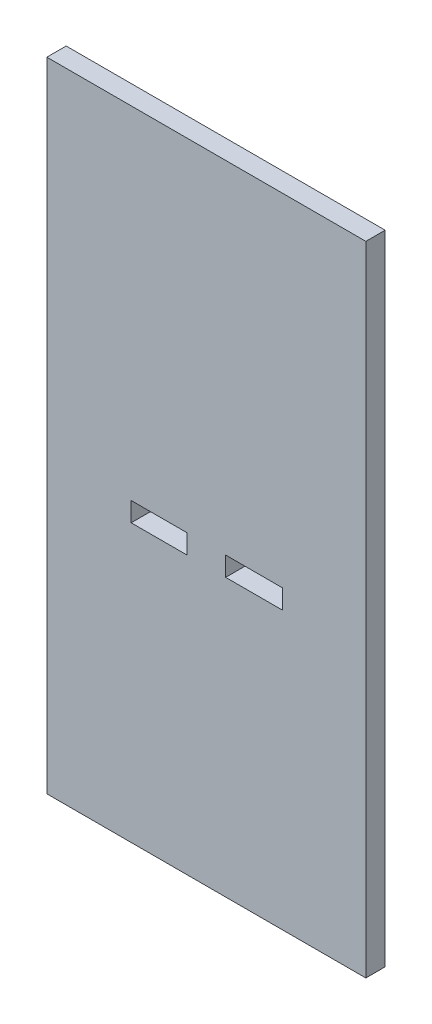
from build123d import *

# Parameters (mm, degrees)
SKETCH1_W           = 88.9
SKETCH1_H           = 177.8
SKETCH1_W_2         = 15.8242
SKETCH1_H_2         = 5.3848
SKETCH1_W_3         = 15.5702
BOSS_EXTRUDE1_DEPTH = 5.3848


with BuildPart() as part:
    # Sketch1 → Boss-Extrude1 (new body)
    with BuildSketch(Plane.XY):
        with Locations((493.483425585, 508.373328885)):
            Rectangle(SKETCH1_W, SKETCH1_H)
        with Locations((506.780325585, 499.330928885)):
            Rectangle(SKETCH1_W_2, SKETCH1_H_2, mode=Mode.SUBTRACT)
        with Locations((480.313525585, 499.330928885)):
            Rectangle(SKETCH1_W_3, SKETCH1_H_2, mode=Mode.SUBTRACT)
    extrude(amount=BOSS_EXTRUDE1_DEPTH)


solid = part.part
